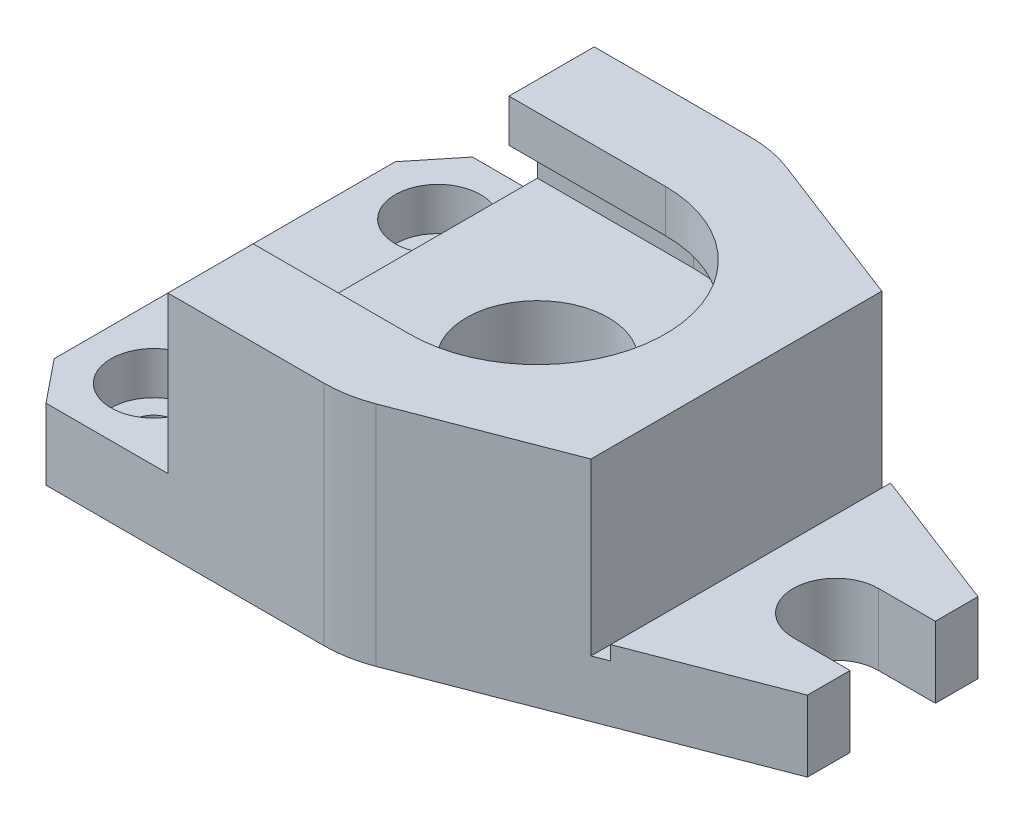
from build123d import *

# Parameters (mm, degrees)
EXTRUDE_1_DEPTH     = 5
EXTRUDE_2_DEPTH     = 5
EXTRUDE_3_DEPTH     = 3
EXTRUDE_4_DEPTH     = 3
SKETCH_9_R          = 5
CUT_EXTRUDE_1_DEPTH = 31.822070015
SKETCH_10_R         = 1.5
CUT_EXTRUDE_2_DEPTH = 32.160872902
SKETCH_11_R         = 3
CUT_EXTRUDE_3_DEPTH = 3
CUT_EXTRUDE_4_DEPTH = 1


with BuildPart() as part:
    # Sketch 2 → Extrude 1 (new body)
    with BuildSketch(Plane(origin=(0, 0, 0), x_dir=(1, 0, 0), z_dir=(0, 1, 0))):
        with BuildLine():
            Line((-22, -12), (-22, 12))
            Line((-22, 12), (-19.574821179, 15))
            Line((-19.574821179, 15), (0, 15))
            ThreePointArc((0, 15), (1.56985, 14.855510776), (3.086951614, 14.426898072))
            Line((3.086951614, 14.426898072), (25, 6))
            Line((25, 6), (25, 3))
            Line((25, 3), (21, 3))
            ThreePointArc((21, 3), (18, 0), (21, -3))
            Line((21, -3), (25, -3))
            Line((25, -3), (25, -6))
            Line((25, -6), (3.086951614, -14.426898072))
            ThreePointArc((3.086951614, -14.426898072), (1.56985, -14.855510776), (0, -15))
            Line((0, -15), (-19.574821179, -15))
            Line((-19.574821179, -15), (-22, -12))
        make_face()
    extrude(amount=EXTRUDE_1_DEPTH)

    # Sketch 5 → Extrude 2 (add)
    with BuildSketch(Plane(origin=(0, 5, 0), x_dir=(1, 0, 0), z_dir=(0, 1, 0))):
        with BuildLine():
            Line((14, 10.230168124), (14, -10.230168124))
            Line((14, -10.230168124), (3.086951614, -14.426898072))
            ThreePointArc((3.086951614, -14.426898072), (1.56985, -14.855510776), (0, -15))
            Line((0, -15), (-11, -15))
            Line((-11, -15), (-11, -11))
            Line((-11, -11), (-11, 11))
            Line((-11, 11), (-11, 15))
            Line((-11, 15), (0, 15))
            ThreePointArc((0, 15), (1.56985, 14.855510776), (3.086951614, 14.426898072))
            Line((3.086951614, 14.426898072), (14, 10.230168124))
        make_face()
    extrude(amount=EXTRUDE_2_DEPTH)

    # Sketch 7 → Extrude 3 (add)
    with BuildSketch(Plane(origin=(0, 10, 0), x_dir=(1, 0, 0), z_dir=(0, 1, 0))):
        with BuildLine():
            Line((0, 11), (-11, 11))
            Line((-11, 11), (-11, 15))
            Line((-11, 15), (0, 15))
            ThreePointArc((0, 15), (1.56985, 14.855510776), (3.086951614, 14.426898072))
            Line((3.086951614, 14.426898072), (14, 10.230168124))
            Line((14, 10.230168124), (14, -10.230168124))
            Line((14, -10.230168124), (3.086951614, -14.426898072))
            ThreePointArc((3.086951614, -14.426898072), (1.56985, -14.855510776), (0, -15))
            Line((0, -15), (-11, -15))
            Line((-11, -15), (-11, -11))
            Line((-11, -11), (0, -11))
            ThreePointArc((0, -11), (11, 0), (0, 11))
        make_face()
    extrude(amount=EXTRUDE_3_DEPTH)

    # Sketch 8 → Extrude 4 (add)
    with BuildSketch(Plane(origin=(0, 13, 0), x_dir=(1, 0, 0), z_dir=(0, 1, 0))):
        with BuildLine():
            Line((0, 9), (-11, 9))
            Line((-11, 9), (-11, 15))
            Line((-11, 15), (0, 15))
            ThreePointArc((0, 15), (1.56985, 14.855510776), (3.086951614, 14.426898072))
            Line((3.086951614, 14.426898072), (14, 10.230168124))
            Line((14, 10.230168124), (14, -10.230168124))
            Line((14, -10.230168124), (3.086951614, -14.426898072))
            ThreePointArc((3.086951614, -14.426898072), (1.56985, -14.855510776), (0, -15))
            Line((0, -15), (-11, -15))
            Line((-11, -15), (-11, -9))
            Line((-11, -9), (0, -9))
            ThreePointArc((0, -9), (9, 0), (0, 9))
        make_face()
    extrude(amount=EXTRUDE_4_DEPTH)

    # Sketch 9 → Cut-Extrude 1 (cut, through all)
    with BuildSketch(Plane(origin=(0, 10, 0), x_dir=(1, 0, 0), z_dir=(0, 1, 0))):
        with Locations(Location((0, 0, 0), (0, 0, 270))):
            Circle(SKETCH_9_R)
    extrude(amount=-CUT_EXTRUDE_1_DEPTH, mode=Mode.SUBTRACT)

    # Sketch 10 → Cut-Extrude 2 (cut, through all)
    with BuildSketch(Plane(origin=(0, 5, 0), x_dir=(1, 0, 0), z_dir=(0, 1, 0))):
        with Locations(Location((-17, 10, 0), (0, 0, 270))):
            Circle(SKETCH_10_R)
        with Locations(Location((-17, -10, 0), (0, 0, 90))):
            Circle(SKETCH_10_R)
    extrude(amount=-CUT_EXTRUDE_2_DEPTH, mode=Mode.SUBTRACT)

    # Sketch 11 → Cut-Extrude 3 (cut)
    with BuildSketch(Plane(origin=(0, 5, 0), x_dir=(1, 0, 0), z_dir=(0, 1, 0))):
        with Locations(Location((-17, 10, 0), (0, 0, 270))):
            Circle(SKETCH_11_R)
        with Locations(Location((-17, -10, 0), (0, 0, 90))):
            Circle(SKETCH_11_R)
    extrude(amount=-CUT_EXTRUDE_3_DEPTH, mode=Mode.SUBTRACT)

    # Sketch 13 → Cut-Extrude 4 (cut)
    with BuildSketch(Plane(origin=(0, 5, 0), x_dir=(1, 0, 0), z_dir=(0, 1, 0))):
        Polygon((14, 10.230168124), (14, -10.230168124), (15, -9.845607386), (15, 9.845607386), align=None)
    extrude(amount=-CUT_EXTRUDE_4_DEPTH, mode=Mode.SUBTRACT)


solid = part.part
